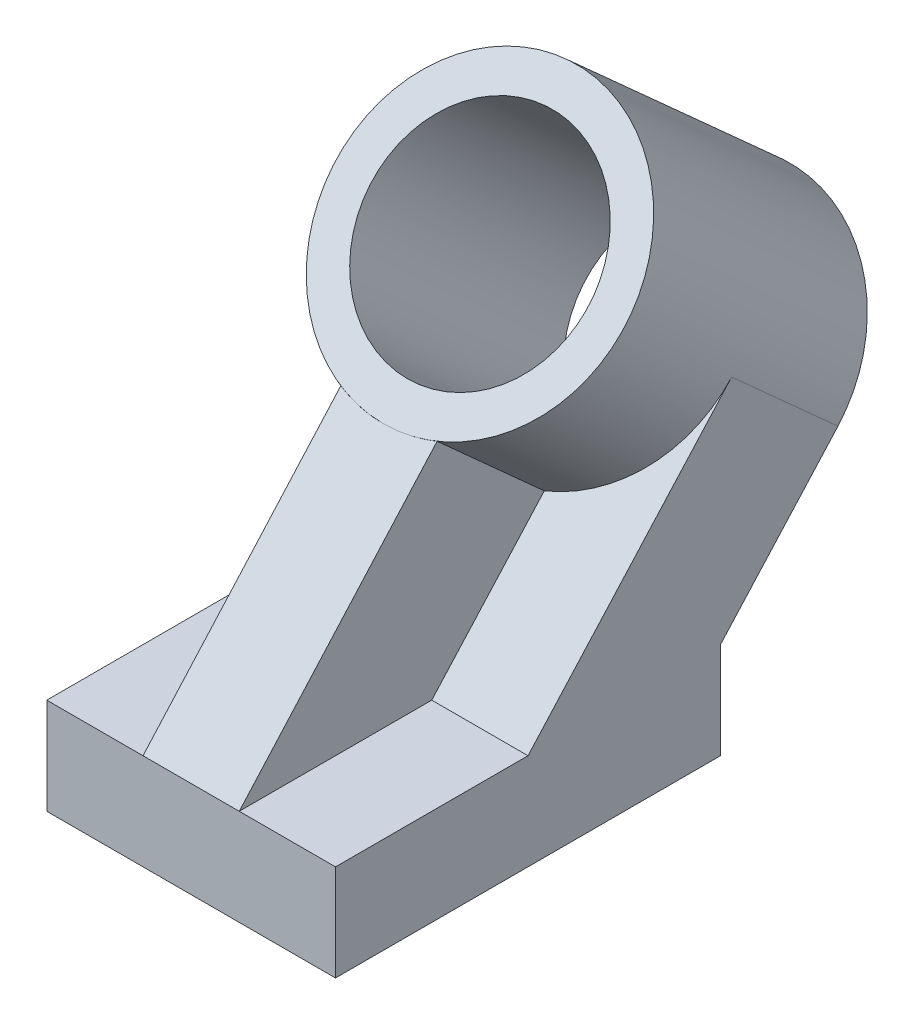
from build123d import *

# Parameters (mm, degrees)
BOSS_EXTRUDE1_DEPTH = 38.1
CUT_EXTRUDE5_DEPTH  = 38.1
BOSS_EXTRUDE2_START = 38.1
SKETCH7_R           = 38.1
BOSS_EXTRUDE2_DEPTH = 38.1
CUT_EXTRUDE6_REACH  = 185.935
SKETCH8_R           = 28.575
RIB8_REACH          = 181.588
SKETCH13_WALL_W     = 446.90118974
SKETCH13_WALL_H     = 25.4


with BuildPart() as part:
    # Sketch1 → Boss-Extrude1 (new, symmetric)
    with BuildSketch(Plane(origin=(0, 0, 0), x_dir=(0, 0, -1), z_dir=(1, 0, 0))):
        Polygon((-50.8, 0), (50.8, 0), (50.8, 25.4), (107.285550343, 88.133559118), (79.230527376, 113.39441526), (0, 25.4), (-50.8, 25.4), align=None)
    extrude(amount=BOSS_EXTRUDE1_DEPTH, both=True)

    # Sketch6 → Cut-Extrude5 (cut)
    with BuildSketch(Plane(origin=(0, 11.372488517, 12.630428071), x_dir=(1, 0, 0), z_dir=(0, 0.6691306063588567, 0.7431448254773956))):
        with BuildLine():
            ThreePointArc((-38.1, 99.184043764), (-26.940768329, 126.124812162), (9.8e-08, 137.284043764))
            Line((9.8e-08, 137.284043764), (-38.1, 137.284043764))
            Line((-38.1, 137.284043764), (-38.1, 99.184043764))
        make_face()
        with BuildLine():
            ThreePointArc((9.8e-08, 137.284043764), (26.940768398, 126.124812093), (38.1, 99.184043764))
            Line((38.1, 99.184043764), (38.1, 137.284043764))
            Line((38.1, 137.284043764), (9.8e-08, 137.284043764))
        make_face()
    extrude(amount=-CUT_EXTRUDE5_DEPTH, mode=Mode.SUBTRACT)

    # Sketch7 → Boss-Extrude2 (add)
    with BuildSketch(Plane(origin=(0, 11.372488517, 12.630428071), x_dir=(1, 0, 0), z_dir=(0, 0.6691306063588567, 0.7431448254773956)).offset(BOSS_EXTRUDE2_START)):
        with Locations(Location((0, 99.184043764, 0), (0, 0, 270))):
            Circle(SKETCH7_R)
    extrude(amount=-BOSS_EXTRUDE2_DEPTH)

    # Sketch8 → Cut-Extrude6 (cut, up to next)
    with BuildSketch(Plane(origin=(0, 36.866364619, 40.944245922), x_dir=(1, 0, 0), z_dir=(0, 0.6691306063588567, 0.7431448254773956)), mode=Mode.PRIVATE) as cut_extrude6_sk1:
        with Locations(Location((0, 99.184043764, 0), (0, 0, 270))):
            Circle(SKETCH8_R)
    cut_extrude6_tool1 = extrude(cut_extrude6_sk1.sketch, amount=-CUT_EXTRUDE6_REACH, mode=Mode.PRIVATE) & part.part
    add(cut_extrude6_tool1.solids().sort_by_distance((0, 110.574474, -25.422833))[0], mode=Mode.SUBTRACT)

    # Sketch13 wall → Rib8 (add, up to next)
    with BuildSketch(Plane(origin=(0, 57.369555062, 22.248786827), x_dir=(0, -0.745856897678, 0.666106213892), z_dir=(0, -0.666106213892, -0.745856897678)), mode=Mode.PRIVATE) as rib8_sk1:
        Rectangle(SKETCH13_WALL_W, SKETCH13_WALL_H)
    rib8_tool1 = extrude(rib8_sk1.sketch, amount=RIB8_REACH, mode=Mode.PRIVATE) - part.part
    add(rib8_tool1.solids().sort_by_distance((0, 57.369555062, 22.248786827))[0])


solid = part.part
